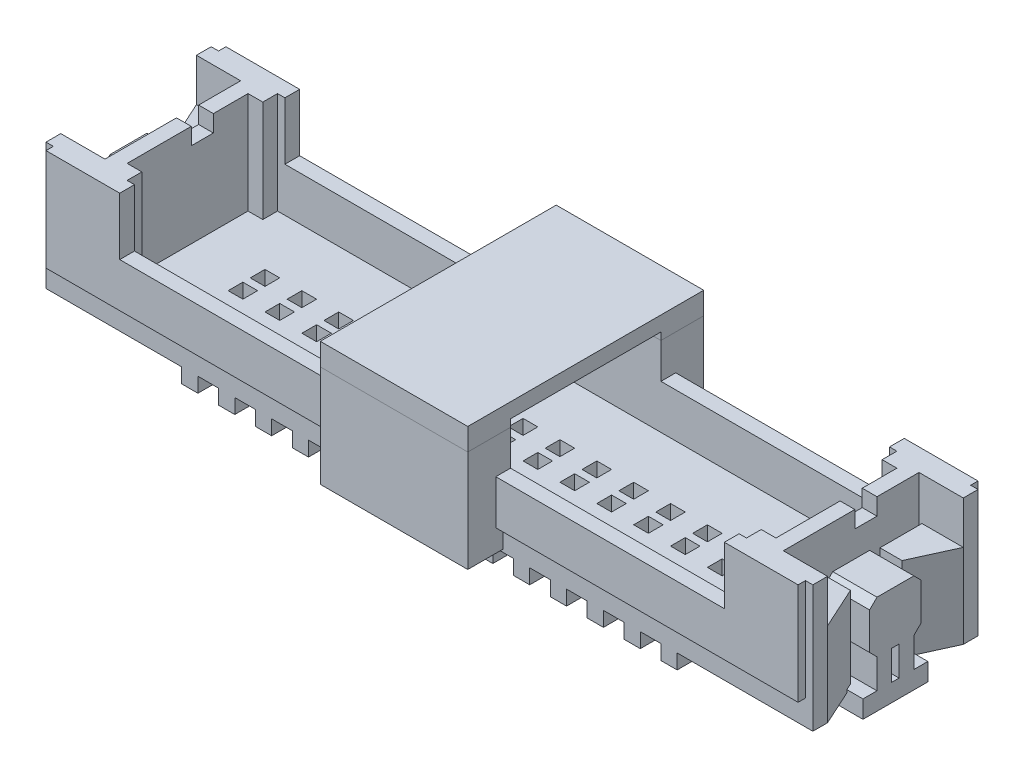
from build123d import *

# Parameters (mm, degrees)
BOSS_EXTRUDE4_START    = -0.75
BOSS_EXTRUDE4_DEPTH    = 3.45
BOSS_EXTRUDE6_DEPTH    = 4.2
BOSS_EXTRUDE6_2_DEPTH  = 4.2
BOSS_EXTRUDE6_3_DEPTH  = 4.2
BOSS_EXTRUDE6_4_DEPTH  = 4.2
BOSS_EXTRUDE7_START    = -1.95
BOSS_EXTRUDE7_DEPTH    = 2.25
BOSS_EXTRUDE8_START    = -3.45
BOSS_EXTRUDE8_DEPTH    = 0.75
BOSS_EXTRUDE9_START    = -1.45
BOSS_EXTRUDE9_DEPTH    = 2.75
BOSS_EXTRUDE10_START   = -3.2
BOSS_EXTRUDE10_DEPTH   = 1
BOSS_EXTRUDE11_DEPTH   = 4.2
BOSS_EXTRUDE12_START   = -0.57112
SKETCH6_12_W           = 0.5
SKETCH6_12_H           = 0.75
BOSS_EXTRUDE12_DEPTH   = 3.62888
BOSS_EXTRUDE14_DEPTH   = 1.5
BOSS_EXTRUDE15_DEPTH   = 1.5
SKETCH13_W             = 10.25
SKETCH13_H             = 0.75
CUT_EXTRUDE1_DEPTH     = 0.25
SKETCH15_W             = 10.25
SKETCH15_H             = 0.75
CUT_EXTRUDE2_DEPTH     = 0.25
SKETCH10_W             = 18.2
SKETCH10_H             = 5.6
BOSS_EXTRUDE13_DEPTH   = 0.6
SKETCH16_W             = 2
SKETCH16_H             = 2.2
BOSS_EXTRUDE16_DEPTH   = 0.6
BOSS_EXTRUDE16_2_DEPTH = 0.6
BOSS_EXTRUDE17_DEPTH   = 0.1
SKETCH19_W             = 5.1
SKETCH19_H             = 2.7
CUT_EXTRUDE3_DEPTH     = 5
SKETCH20_W             = 5
SKETCH20_H             = 8
BOSS_EXTRUDE18_DEPTH   = 0.75
SKETCH18_W             = 0.5
SKETCH18_H             = 0.5
CUT_EXTRUDE4_DEPTH     = 0.5
SKETCH21_W             = 0.7
SKETCH21_H             = 1.7
CUT_EXTRUDE5_DEPTH     = 0.5
SKETCH22_W             = 5.1
SKETCH22_H             = 0.25
CUT_EXTRUDE6_DEPTH     = 5


with BuildPart() as part:
    # Sketch6 → Boss-Extrude4 (new body)
    with BuildSketch(Plane(origin=(0, 0, 0), x_dir=(1, 0, 0), z_dir=(0, 1, 0)).offset(BOSS_EXTRUDE4_START)):
        Polygon((-2.5, 4), (-2.5, 3.05), (-2.5, 2.55), (-2.5, -2.55), (-2.5, -3.05), (-2.5, -4), (2.5, -4), (2.5, -3.05), (2.5, -2.55), (2.5, 2.55), (2.5, 3.05), (2.5, 4), align=None)
    extrude(amount=-BOSS_EXTRUDE4_DEPTH)



with BuildPart() as body_2:
    # Sketch6_4 → Boss-Extrude6 (new body)
    with BuildSketch(Plane(origin=(0, 0, 0), x_dir=(1, 0, 0), z_dir=(0, 1, 0))):
        Polygon((-10.25, -3.05), (-10.25, -2.55), (-10.5, -2.55), (-10.5, -2.05), (-11, -2.05), (-11, -2.3), (-11.5, -2.3), (-11.6, -2.3), (-13, -2.3), (-13, -2.8), (-12.75, -2.8), (-12.75, -3.05), align=None)
    extrude(amount=-BOSS_EXTRUDE6_DEPTH)


with BuildPart() as body_3:
    # Sketch6_4 → Boss-Extrude6 2 (new body)
    with BuildSketch(Plane(origin=(0, 0, 0), x_dir=(1, 0, 0), z_dir=(0, 1, 0))):
        Polygon((-10.25, 2.55), (-10.25, 3.05), (-12.75, 3.05), (-12.75, 2.8), (-13, 2.8), (-13, 2.3), (-11.6, 2.3), (-11.5, 2.3), (-11, 2.3), (-11, 2.05), (-10.5, 2.05), (-10.5, 2.55), align=None)
    extrude(amount=-BOSS_EXTRUDE6_2_DEPTH)


with BuildPart() as body_4:
    # Sketch6_4 → Boss-Extrude6 3 (new body)
    with BuildSketch(Plane(origin=(0, 0, 0), x_dir=(1, 0, 0), z_dir=(0, 1, 0))):
        Polygon((10.5, -2.55), (10.25, -2.55), (10.25, -3.05), (12.75, -3.05), (12.75, -2.8), (13, -2.8), (13, -2.3), (11.6, -2.3), (11.5, -2.3), (11, -2.3), (11, -2.05), (10.5, -2.05), align=None)
    extrude(amount=-BOSS_EXTRUDE6_3_DEPTH)


with BuildPart() as body_5:
    # Sketch6_4 → Boss-Extrude6 4 (new body)
    with BuildSketch(Plane(origin=(0, 0, 0), x_dir=(1, 0, 0), z_dir=(0, 1, 0))):
        Polygon((10.25, 3.05), (10.25, 2.55), (10.5, 2.55), (10.5, 2.05), (11, 2.05), (11, 2.3), (11.5, 2.3), (11.6, 2.3), (13, 2.3), (13, 2.8), (12.75, 2.8), (12.75, 3.05), align=None)
    extrude(amount=-BOSS_EXTRUDE6_4_DEPTH)


with BuildPart() as part_1:
    add(part.part)

    add(body_2.part)  # Boss-Extrude7 merges body 2

    add(body_3.part)  # Boss-Extrude7 merges body 3

    add(body_4.part)  # Boss-Extrude7 merges body 4

    add(body_5.part)  # Boss-Extrude7 merges body 5
    # Sketch6_5 → Boss-Extrude7 (add)
    with BuildSketch(Plane(origin=(0, 0, 0), x_dir=(1, 0, 0), z_dir=(0, 1, 0)).offset(BOSS_EXTRUDE7_START)):
        Polygon((-2.5, -3.05), (-2.5, -2.55), (-10.25, -2.55), (-10.25, -3.05), (-8.75, -3.05), align=None)
        Polygon((-2.5, 2.55), (-2.5, 3.05), (-8.75, 3.05), (-10.25, 3.05), (-10.25, 2.55), align=None)
        Polygon((10.25, -2.55), (2.5, -2.55), (2.5, -3.05), (8.75, -3.05), (10.25, -3.05), align=None)
        Polygon((8.75, 3.05), (2.5, 3.05), (2.5, 2.55), (10.25, 2.55), (10.25, 3.05), align=None)
    extrude(amount=-BOSS_EXTRUDE7_DEPTH)

    # Sketch6_7 → Boss-Extrude8 (add)
    with BuildSketch(Plane(origin=(0, 0, 0), x_dir=(1, 0, 0), z_dir=(0, 1, 0)).offset(BOSS_EXTRUDE8_START)):
        Polygon((-2.5, -2.55), (-2.5, 2.55), (-10.25, 2.55), (-10.5, 2.55), (-10.5, 2.05), (-11, 2.05), (-11, 0.875), (-11, 0.125), (-11, -2.05), (-10.5, -2.05), (-10.5, -2.55), (-10.25, -2.55), align=None)
        Polygon((10.25, 2.55), (2.5, 2.55), (2.5, -2.55), (10.25, -2.55), (10.5, -2.55), (10.5, -2.05), (11, -2.05), (11, 0.125), (11, 0.875), (11, 2.05), (10.5, 2.05), (10.5, 2.55), align=None)
    extrude(amount=-BOSS_EXTRUDE8_DEPTH)

    # Sketch6_8 → Boss-Extrude9 (add)
    with BuildSketch(Plane(origin=(0, 0, 0), x_dir=(1, 0, 0), z_dir=(0, 1, 0)).offset(BOSS_EXTRUDE9_START)):
        Polygon((-12.35, -0.875), (-13, -2.3), (-11.6, -2.3), (-11.6, -0.875), align=None)
        Polygon((-11.6, 2.3), (-13, 2.3), (-12.35, 0.875), (-11.6, 0.875), align=None)
        Polygon((11.6, -2.3), (13, -2.3), (12.35, -0.875), (11.6, -0.875), align=None)
        Polygon((12.35, 0.875), (13, 2.3), (11.6, 2.3), (11.6, 0.875), align=None)
    extrude(amount=-BOSS_EXTRUDE9_DEPTH)

    # Sketch6_9 → Boss-Extrude10 (add)
    with BuildSketch(Plane(origin=(0, 0, 0), x_dir=(1, 0, 0), z_dir=(0, 1, 0)).offset(BOSS_EXTRUDE10_START)):
        with BuildLine():
            Line((-11.5, 2.3), (-11.6, 2.3))
            Line((-11.6, 2.3), (-11.6, 0.875))
            Line((-11.6, 0.875), (-11.6, 0.625))
            Line((-11.6, 0.625), (-13, 0.625))
            Line((-13, 0.625), (-13, 0.125))
            Line((-13, 0.125), (-12.5, 0.125))
            ThreePointArc((-12.5, 0.125), (-12.375, 0), (-12.5, -0.125))
            Line((-12.5, -0.125), (-13, -0.125))
            Line((-13, -0.125), (-13, -0.625))
            Line((-13, -0.625), (-11.6, -0.625))
            Line((-11.6, -0.625), (-11.6, -0.875))
            Line((-11.6, -0.875), (-11.6, -2.3))
            Line((-11.6, -2.3), (-11.5, -2.3))
            Line((-11.5, -2.3), (-11.5, 0.125))
            Line((-11.5, 0.125), (-11.5, 0.875))
            Line((-11.5, 0.875), (-11.5, 2.3))
        make_face()
        with BuildLine():
            Line((11.5, 2.3), (11.5, 0.875))
            Line((11.5, 0.875), (11.5, 0.125))
            Line((11.5, 0.125), (11.5, -2.3))
            Line((11.5, -2.3), (11.6, -2.3))
            Line((11.6, -2.3), (11.6, -0.875))
            Line((11.6, -0.875), (11.6, -0.625))
            Line((11.6, -0.625), (13, -0.625))
            Line((13, -0.625), (13, -0.125))
            Line((13, -0.125), (12.5, -0.125))
            ThreePointArc((12.5, -0.125), (12.375, 0), (12.5, 0.125))
            Line((12.5, 0.125), (13, 0.125))
            Line((13, 0.125), (13, 0.625))
            Line((13, 0.625), (11.6, 0.625))
            Line((11.6, 0.625), (11.6, 0.875))
            Line((11.6, 0.875), (11.6, 2.3))
            Line((11.6, 2.3), (11.5, 2.3))
        make_face()
    extrude(amount=-BOSS_EXTRUDE10_DEPTH)

    # Sketch6_10 → Boss-Extrude11 (add)
    with BuildSketch(Plane(origin=(0, 0, 0), x_dir=(1, 0, 0), z_dir=(0, 1, 0))):
        Polygon((-11, 0.875), (-11, 2.05), (-11, 2.3), (-11.5, 2.3), (-11.5, 0.875), align=None)
        Polygon((-11, -2.3), (-11, -2.05), (-11, 0.125), (-11.5, 0.125), (-11.5, -2.3), align=None)
        Polygon((11, 2.3), (11, 2.05), (11, 0.875), (11.5, 0.875), (11.5, 2.3), align=None)
        Polygon((11, 0.125), (11, -2.05), (11, -2.3), (11.5, -2.3), (11.5, 0.125), align=None)
    extrude(amount=-BOSS_EXTRUDE11_DEPTH)

    # Sketch6_12 → Boss-Extrude12 (add)
    with BuildSketch(Plane(origin=(0, 0, 0), x_dir=(1, 0, 0), z_dir=(0, 1, 0)).offset(BOSS_EXTRUDE12_START)):
        with Locations((-11.25, 0.5)):
            Rectangle(SKETCH6_12_W, SKETCH6_12_H)
        with Locations((11.25, 0.5)):
            Rectangle(SKETCH6_12_W, SKETCH6_12_H)
    extrude(amount=-BOSS_EXTRUDE12_DEPTH)

    # Sketch11 → Boss-Extrude14 (add)
    with BuildSketch(Plane.ZY.offset(13)):
        Polygon((-0.625, -3.2), (0.625, -3.2), (0.875, -2.95), (0.875, -1.7), (0.625, -1.45), (-0.625, -1.45), (-0.875, -1.7), (-0.875, -2.95), align=None)
    extrude(amount=-BOSS_EXTRUDE14_DEPTH)

    # Sketch12 → Boss-Extrude15 (add)
    with BuildSketch(Plane(origin=(13, 0, 0), x_dir=(0, 0, -1), z_dir=(1, 0, 0))):
        Polygon((-0.625, -3.2), (-0.875, -2.95), (-0.875, -1.7), (-0.625, -1.45), (0.625, -1.45), (0.875, -1.7), (0.875, -2.95), (0.625, -3.2), align=None)
    extrude(amount=-BOSS_EXTRUDE15_DEPTH)

    # Sketch13 → Cut-Extrude1 (cut)
    with BuildSketch(Plane.XY.offset(3.05)):
        with Locations((-7.625, -3.825)):
            Rectangle(SKETCH13_W, SKETCH13_H)
        with Locations((7.625, -3.825)):
            Rectangle(SKETCH13_W, SKETCH13_H)
    extrude(amount=-CUT_EXTRUDE1_DEPTH, mode=Mode.SUBTRACT)

    # Sketch15 → Cut-Extrude2 (cut)
    with BuildSketch(Plane(origin=(0, 0, -3.05), x_dir=(-1, 0, 0), z_dir=(0, 0, -1))):
        with Locations((-7.625, -3.825)):
            Rectangle(SKETCH15_W, SKETCH15_H)
        with Locations((7.625, -3.825)):
            Rectangle(SKETCH15_W, SKETCH15_H)
    extrude(amount=-CUT_EXTRUDE2_DEPTH, mode=Mode.SUBTRACT)

    # Sketch10 → Boss-Extrude13 (add)
    with BuildSketch(Plane.XZ.offset(4.2)):
        Rectangle(SKETCH10_W, SKETCH10_H)
    extrude(amount=BOSS_EXTRUDE13_DEPTH)



with BuildPart() as body_2_2:
    # Sketch16 → Boss-Extrude16 (new body)
    with BuildSketch(Plane.XZ.offset(4.2)):
        with Locations((-12, 0)):
            Rectangle(SKETCH16_W, SKETCH16_H)
    extrude(amount=BOSS_EXTRUDE16_DEPTH)


with BuildPart() as body_3_2:
    # Sketch16 → Boss-Extrude16 2 (new body)
    with BuildSketch(Plane.XZ.offset(4.2)):
        with Locations((12, 0)):
            Rectangle(SKETCH16_W, SKETCH16_H)
    extrude(amount=BOSS_EXTRUDE16_2_DEPTH)


with BuildPart() as part_2:
    add(part_1.part)

    add(body_2_2.part)  # Boss-Extrude17 merges body 2 2

    add(body_3_2.part)  # Boss-Extrude17 merges body 3 2
    # Sketch17 → Boss-Extrude17 (add)
    with BuildSketch(Plane.XZ.offset(4.2)):
        Polygon((-13, 2.8), (-13, 2.3), (-12.452631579, 1.1), (-12.452631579, -1.1), (-13, -2.3), (-13, -2.8), (13, -2.8), (13, -2.3), (12.452631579, -1.1), (12.452631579, 1.1), (13, 2.3), (13, 2.8), align=None)
    extrude(amount=BOSS_EXTRUDE17_DEPTH)

    # Sketch19 → Cut-Extrude3 (cut)
    with BuildSketch(Plane.ZY.offset(2.5)):
        with Locations((0, -2.1)):
            Rectangle(SKETCH19_W, SKETCH19_H)
    extrude(amount=-CUT_EXTRUDE3_DEPTH, mode=Mode.SUBTRACT)

    # Sketch18 → Cut-Extrude4 (cut)
    with BuildSketch(Plane(origin=(0, -3.45, 0), x_dir=(1, 0, 0), z_dir=(0, 1, 0))):
        with Locations((-8.75, 0.375)):
            Rectangle(SKETCH18_W, SKETCH18_H)
        with Locations((-7.5, 0.375)):
            Rectangle(SKETCH18_W, SKETCH18_H)
        with Locations((-8.75, -0.375)):
            Rectangle(SKETCH18_W, SKETCH18_H)
        with Locations((-7.5, -0.375)):
            Rectangle(SKETCH18_W, SKETCH18_H)
        with Locations((-6.25, 0.375)):
            Rectangle(SKETCH18_W, SKETCH18_H)
        with Locations((-6.25, -0.375)):
            Rectangle(SKETCH18_W, SKETCH18_H)
        with Locations((-5, 0.375)):
            Rectangle(SKETCH18_W, SKETCH18_H)
        with Locations((-5, -0.375)):
            Rectangle(SKETCH18_W, SKETCH18_H)
        with Locations((-3.75, 0.375)):
            Rectangle(SKETCH18_W, SKETCH18_H)
        with Locations((-3.75, -0.375)):
            Rectangle(SKETCH18_W, SKETCH18_H)
        with Locations((-2.5, 0.375)):
            Rectangle(SKETCH18_W, SKETCH18_H)
        with Locations((-2.5, -0.375)):
            Rectangle(SKETCH18_W, SKETCH18_H)
        with Locations((-1.25, 0.375)):
            Rectangle(SKETCH18_W, SKETCH18_H)
        with Locations((-1.25, -0.375)):
            Rectangle(SKETCH18_W, SKETCH18_H)
        with Locations((0, 0.375)):
            Rectangle(SKETCH18_W, SKETCH18_H)
        with Locations((0, -0.375)):
            Rectangle(SKETCH18_W, SKETCH18_H)
        with Locations((1.25, 0.375)):
            Rectangle(SKETCH18_W, SKETCH18_H)
        with Locations((1.25, -0.375)):
            Rectangle(SKETCH18_W, SKETCH18_H)
        with Locations((2.5, 0.375)):
            Rectangle(SKETCH18_W, SKETCH18_H)
        with Locations((2.5, -0.375)):
            Rectangle(SKETCH18_W, SKETCH18_H)
        with Locations((3.75, 0.375)):
            Rectangle(SKETCH18_W, SKETCH18_H)
        with Locations((3.75, -0.375)):
            Rectangle(SKETCH18_W, SKETCH18_H)
        with Locations((5, 0.375)):
            Rectangle(SKETCH18_W, SKETCH18_H)
        with Locations((5, -0.375)):
            Rectangle(SKETCH18_W, SKETCH18_H)
        with Locations((6.25, 0.375)):
            Rectangle(SKETCH18_W, SKETCH18_H)
        with Locations((6.25, -0.375)):
            Rectangle(SKETCH18_W, SKETCH18_H)
        with Locations((7.5, 0.375)):
            Rectangle(SKETCH18_W, SKETCH18_H)
        with Locations((7.5, -0.375)):
            Rectangle(SKETCH18_W, SKETCH18_H)
        with Locations((8.75, 0.375)):
            Rectangle(SKETCH18_W, SKETCH18_H)
        with Locations((8.75, -0.375)):
            Rectangle(SKETCH18_W, SKETCH18_H)
    extrude(amount=-CUT_EXTRUDE4_DEPTH, mode=Mode.SUBTRACT)

    # Sketch21 → Cut-Extrude5 (cut)
    with BuildSketch(Plane.XZ.offset(4.8)):
        with Locations((-7.5, 3)):
            Rectangle(SKETCH21_W, SKETCH21_H)
        with Locations((-8.75, 3)):
            Rectangle(SKETCH21_W, SKETCH21_H)
        with Locations((-6.25, 3)):
            Rectangle(SKETCH21_W, SKETCH21_H)
        with Locations((-5, 3)):
            Rectangle(SKETCH21_W, SKETCH21_H)
        with Locations((-3.75, 3)):
            Rectangle(SKETCH21_W, SKETCH21_H)
        with Locations((-2.5, 3)):
            Rectangle(SKETCH21_W, SKETCH21_H)
        with Locations((-1.25, 3)):
            Rectangle(SKETCH21_W, SKETCH21_H)
        with Locations((0, 3)):
            Rectangle(SKETCH21_W, SKETCH21_H)
        with Locations((1.25, 3)):
            Rectangle(SKETCH21_W, SKETCH21_H)
        with Locations((2.5, 3)):
            Rectangle(SKETCH21_W, SKETCH21_H)
        with Locations((3.75, 3)):
            Rectangle(SKETCH21_W, SKETCH21_H)
        with Locations((5, 3)):
            Rectangle(SKETCH21_W, SKETCH21_H)
        with Locations((6.25, 3)):
            Rectangle(SKETCH21_W, SKETCH21_H)
        with Locations((7.5, 3)):
            Rectangle(SKETCH21_W, SKETCH21_H)
        with Locations((8.75, 3)):
            Rectangle(SKETCH21_W, SKETCH21_H)
        with Locations((8.75, -3)):
            Rectangle(SKETCH21_W, SKETCH21_H)
        with Locations((7.5, -3)):
            Rectangle(SKETCH21_W, SKETCH21_H)
        with Locations((6.25, -3)):
            Rectangle(SKETCH21_W, SKETCH21_H)
        with Locations((5, -3)):
            Rectangle(SKETCH21_W, SKETCH21_H)
        with Locations((3.75, -3)):
            Rectangle(SKETCH21_W, SKETCH21_H)
        with Locations((2.5, -3)):
            Rectangle(SKETCH21_W, SKETCH21_H)
        with Locations((1.25, -3)):
            Rectangle(SKETCH21_W, SKETCH21_H)
        with Locations((0, -3)):
            Rectangle(SKETCH21_W, SKETCH21_H)
        with Locations((-1.25, -3)):
            Rectangle(SKETCH21_W, SKETCH21_H)
        with Locations((-2.5, -3)):
            Rectangle(SKETCH21_W, SKETCH21_H)
        with Locations((-3.75, -3)):
            Rectangle(SKETCH21_W, SKETCH21_H)
        with Locations((-5, -3)):
            Rectangle(SKETCH21_W, SKETCH21_H)
        with Locations((-6.25, -3)):
            Rectangle(SKETCH21_W, SKETCH21_H)
        with Locations((-7.5, -3)):
            Rectangle(SKETCH21_W, SKETCH21_H)
        with Locations((-8.75, -3)):
            Rectangle(SKETCH21_W, SKETCH21_H)
    extrude(amount=-CUT_EXTRUDE5_DEPTH, mode=Mode.SUBTRACT)


with BuildPart() as body_2_3:
    # Sketch20 → Boss-Extrude18 (new body)
    with BuildSketch(Plane(origin=(0, -0.75, 0), x_dir=(1, 0, 0), z_dir=(0, 1, 0))):
        Rectangle(SKETCH20_W, SKETCH20_H)
    extrude(amount=BOSS_EXTRUDE18_DEPTH)

    # Sketch22 → Cut-Extrude6 (cut)
    with BuildSketch(Plane(origin=(2.5, 0, 0), x_dir=(0, 0, -1), z_dir=(1, 0, 0))):
        with Locations((0, -0.625)):
            Rectangle(SKETCH22_W, SKETCH22_H)
    extrude(amount=-CUT_EXTRUDE6_DEPTH, mode=Mode.SUBTRACT)


solid = Compound([part_2.part, body_2_3.part])
